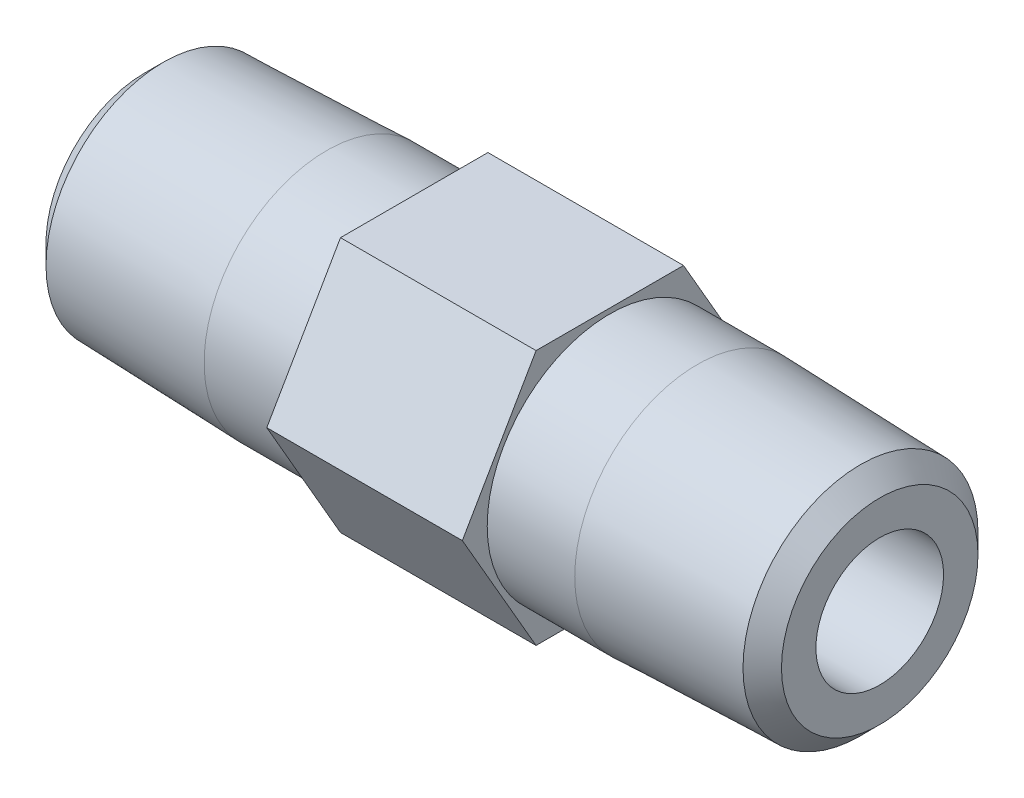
ISO-10303-21;
HEADER;
FILE_DESCRIPTION(('STEP AP214'),'2;1');
FILE_NAME('part.step','',(''),(''),'','','');
FILE_SCHEMA(('AUTOMOTIVE_DESIGN { 1 0 10303 214 1 1 1 1 }'));
ENDSEC;
DATA;
#1=APPLICATION_CONTEXT('core data for automotive mechanical design processes');
#2=APPLICATION_PROTOCOL_DEFINITION('international standard','automotive_design',2000,#1);
#3=PRODUCT_CONTEXT('',#1,'mechanical');
#4=PRODUCT('Part','Part','',(#3));
#5=PRODUCT_RELATED_PRODUCT_CATEGORY('part','',(#4));
#6=PRODUCT_DEFINITION_FORMATION('','',#4);
#7=PRODUCT_DEFINITION_CONTEXT('part definition',#1,'design');
#8=PRODUCT_DEFINITION('design','',#6,#7);
#9=PRODUCT_DEFINITION_SHAPE('','',#8);
#10=(LENGTH_UNIT() NAMED_UNIT(*) SI_UNIT(.MILLI.,.METRE.));
#11=(NAMED_UNIT(*) PLANE_ANGLE_UNIT() SI_UNIT($,.RADIAN.));
#12=(NAMED_UNIT(*) SI_UNIT($,.STERADIAN.) SOLID_ANGLE_UNIT());
#13=UNCERTAINTY_MEASURE_WITH_UNIT(LENGTH_MEASURE(1.E-05),#10,'distance_accuracy_value','');
#14=(GEOMETRIC_REPRESENTATION_CONTEXT(3) GLOBAL_UNCERTAINTY_ASSIGNED_CONTEXT((#13)) GLOBAL_UNIT_ASSIGNED_CONTEXT((#10,
#11,#12)) REPRESENTATION_CONTEXT('',''));
#15=CARTESIAN_POINT('',(0.,0.,0.));
#16=DIRECTION('',(0.,0.,1.));
#17=DIRECTION('',(1.,0.,0.));
#18=AXIS2_PLACEMENT_3D('',#15,#16,#17);
#19=CARTESIAN_POINT('',(15.10284,0.,0.));
#20=DIRECTION('',(1.,0.,0.));
#21=DIRECTION('',(0.,1.,0.));
#22=AXIS2_PLACEMENT_3D('',#19,#20,#21);
#23=PLANE('',#22);
#24=CARTESIAN_POINT('',(15.10284,0.,0.));
#25=DIRECTION('',(-1.,0.,0.));
#26=DIRECTION('',(0.,0.,1.));
#27=AXIS2_PLACEMENT_3D('',#24,#25,#26);
#28=CIRCLE('',#27,3.571875);
#29=CARTESIAN_POINT('',(15.10284,0.,3.571875));
#30=VERTEX_POINT('',#29);
#31=EDGE_CURVE('E19',#30,#30,#28,.T.);
#32=ORIENTED_EDGE('',*,*,#31,.T.);
#33=EDGE_LOOP('',(#32));
#34=FACE_BOUND('',#33,.T.);
#35=ADVANCED_FACE('F16',(#34),#23,.F.);
#36=CARTESIAN_POINT('',(7.55142,0.,0.));
#37=DIRECTION('',(-1.,0.,0.));
#38=DIRECTION('',(0.,0.,1.));
#39=AXIS2_PLACEMENT_3D('',#36,#37,#38);
#40=CYLINDRICAL_SURFACE('',#39,3.571875);
#41=CARTESIAN_POINT('',(0.,0.,0.));
#42=DIRECTION('',(-1.,0.,0.));
#43=DIRECTION('',(0.,0.,1.));
#44=AXIS2_PLACEMENT_3D('',#41,#42,#43);
#45=CIRCLE('',#44,3.571875);
#46=CARTESIAN_POINT('',(0.,0.,3.571875));
#47=VERTEX_POINT('',#46);
#48=EDGE_CURVE('E120',#47,#47,#45,.F.);
#49=ORIENTED_EDGE('',*,*,#48,.F.);
#50=EDGE_LOOP('',(#49));
#51=FACE_BOUND('',#50,.T.);
#52=ORIENTED_EDGE('',*,*,#31,.F.);
#53=EDGE_LOOP('',(#52));
#54=FACE_BOUND('',#53,.T.);
#55=ADVANCED_FACE('F128',(#51,#54),#40,.F.);
#56=CARTESIAN_POINT('',(0.,0.,-3.27012197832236));
#57=DIRECTION('',(-1.,0.,0.));
#58=DIRECTION('',(0.,-1.,0.));
#59=AXIS2_PLACEMENT_3D('',#56,#57,#58);
#60=PLANE('',#59);
#61=CARTESIAN_POINT('',(5.6844286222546E-11,0.,0.));
#62=DIRECTION('',(1.,0.,0.));
#63=DIRECTION('',(0.,1.,0.));
#64=AXIS2_PLACEMENT_3D('',#61,#62,#63);
#65=CIRCLE('',#64,5.4978300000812);
#66=CARTESIAN_POINT('',(5.68448966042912E-11,5.4978300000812,0.));
#67=VERTEX_POINT('',#66);
#68=EDGE_CURVE('E103',#67,#67,#65,.F.);
#69=ORIENTED_EDGE('',*,*,#68,.T.);
#70=EDGE_LOOP('',(#69));
#71=FACE_BOUND('',#70,.T.);
#72=ORIENTED_EDGE('',*,*,#48,.T.);
#73=EDGE_LOOP('',(#72));
#74=FACE_BOUND('',#73,.T.);
#75=ADVANCED_FACE('F130',(#71,#74),#60,.T.);
#76=CARTESIAN_POINT('',(-5.68428084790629E-11,0.,0.));
#77=DIRECTION('',(1.,0.,0.));
#78=DIRECTION('',(0.,1.,0.));
#79=AXIS2_PLACEMENT_3D('',#76,#77,#78);
#80=CONICAL_SURFACE('',#79,5.49782999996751,0.785398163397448);
#81=ORIENTED_EDGE('',*,*,#68,.F.);
#82=EDGE_LOOP('',(#81));
#83=FACE_BOUND('',#82,.T.);
#84=CARTESIAN_POINT('',(1.07591259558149,0.,0.));
#85=DIRECTION('',(1.,0.,0.));
#86=DIRECTION('',(0.,0.,-1.));
#87=AXIS2_PLACEMENT_3D('',#84,#85,#86);
#88=CIRCLE('',#87,6.57374259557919);
#89=CARTESIAN_POINT('',(1.07591259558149,0.,-6.57374259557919));
#90=VERTEX_POINT('',#89);
#91=EDGE_CURVE('E100',#90,#90,#88,.T.);
#92=ORIENTED_EDGE('',*,*,#91,.F.);
#93=EDGE_LOOP('',(#92));
#94=FACE_BOUND('',#93,.T.);
#95=ADVANCED_FACE('F137',(#83,#94),#80,.T.);
#96=CARTESIAN_POINT('',(10.2057199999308,0.,0.));
#97=DIRECTION('',(1.,0.,0.));
#98=DIRECTION('',(0.,1.,0.));
#99=AXIS2_PLACEMENT_3D('',#96,#97,#98);
#100=CONICAL_SURFACE('',#99,6.85799999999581,0.0311250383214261);
#101=ORIENTED_EDGE('',*,*,#91,.T.);
#102=EDGE_LOOP('',(#101));
#103=FACE_BOUND('',#102,.T.);
#104=CARTESIAN_POINT('',(10.20572,0.,0.));
#105=DIRECTION('',(1.,0.,0.));
#106=DIRECTION('',(0.,0.,-1.));
#107=AXIS2_PLACEMENT_3D('',#104,#105,#106);
#108=CIRCLE('',#107,6.858);
#109=CARTESIAN_POINT('',(10.20572,0.,-6.858));
#110=VERTEX_POINT('',#109);
#111=EDGE_CURVE('E96',#110,#110,#108,.T.);
#112=ORIENTED_EDGE('',*,*,#111,.F.);
#113=EDGE_LOOP('',(#112));
#114=FACE_BOUND('',#113,.T.);
#115=ADVANCED_FACE('F198',(#103,#114),#100,.T.);
#116=CARTESIAN_POINT('',(12.65428,0.,0.));
#117=DIRECTION('',(1.,0.,0.));
#118=DIRECTION('',(0.,0.,-1.));
#119=AXIS2_PLACEMENT_3D('',#116,#117,#118);
#120=CYLINDRICAL_SURFACE('',#119,6.858);
#121=ORIENTED_EDGE('',*,*,#111,.T.);
#122=EDGE_LOOP('',(#121));
#123=FACE_BOUND('',#122,.T.);
#124=CARTESIAN_POINT('',(15.10284,0.,0.));
#125=DIRECTION('',(1.,0.,0.));
#126=DIRECTION('',(0.,0.,-1.));
#127=AXIS2_PLACEMENT_3D('',#124,#125,#126);
#128=CIRCLE('',#127,6.858);
#129=CARTESIAN_POINT('',(15.10284,0.,-6.858));
#130=VERTEX_POINT('',#129);
#131=EDGE_CURVE('E99',#130,#130,#128,.F.);
#132=ORIENTED_EDGE('',*,*,#131,.T.);
#133=EDGE_LOOP('',(#132));
#134=FACE_BOUND('',#133,.T.);
#135=ADVANCED_FACE('F194',(#123,#134),#120,.T.);
#136=CARTESIAN_POINT('',(26.04516,0.,0.));
#137=DIRECTION('',(1.,0.,0.));
#138=DIRECTION('',(0.,1.,0.));
#139=AXIS2_PLACEMENT_3D('',#136,#137,#138);
#140=PLANE('',#139);
#141=CARTESIAN_POINT('',(26.04516,0.,0.));
#142=DIRECTION('',(1.,0.,0.));
#143=DIRECTION('',(0.,0.,-1.));
#144=AXIS2_PLACEMENT_3D('',#141,#142,#143);
#145=CIRCLE('',#144,3.571875);
#146=CARTESIAN_POINT('',(26.04516,0.,-3.571875));
#147=VERTEX_POINT('',#146);
#148=EDGE_CURVE('E85',#147,#147,#145,.T.);
#149=ORIENTED_EDGE('',*,*,#148,.T.);
#150=EDGE_LOOP('',(#149));
#151=FACE_BOUND('',#150,.T.);
#152=ADVANCED_FACE('F190',(#151),#140,.T.);
#153=CARTESIAN_POINT('',(15.10284,0.,0.));
#154=DIRECTION('',(1.,0.,0.));
#155=DIRECTION('',(0.,1.,0.));
#156=AXIS2_PLACEMENT_3D('',#153,#154,#155);
#157=PLANE('',#156);
#158=ORIENTED_EDGE('',*,*,#131,.F.);
#159=EDGE_LOOP('',(#158));
#160=FACE_BOUND('',#159,.T.);
#161=DIRECTION('',(0.,0.,-1.));
#162=VECTOR('',#161,1.);
#163=CARTESIAN_POINT('',(15.10284,-7.14375,-4.12444598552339));
#164=LINE('',#163,#162);
#165=CARTESIAN_POINT('',(15.10284,-7.14375,4.12444598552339));
#166=VERTEX_POINT('',#165);
#167=CARTESIAN_POINT('',(15.10284,-7.14375,-4.12444598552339));
#168=VERTEX_POINT('',#167);
#169=EDGE_CURVE('E72',#166,#168,#164,.T.);
#170=ORIENTED_EDGE('',*,*,#169,.F.);
#171=DIRECTION('',(0.,-0.866025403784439,-0.5));
#172=VECTOR('',#171,1.);
#173=CARTESIAN_POINT('',(15.10284,-7.14375,4.12444598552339));
#174=LINE('',#173,#172);
#175=CARTESIAN_POINT('',(15.10284,0.,8.24889197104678));
#176=VERTEX_POINT('',#175);
#177=EDGE_CURVE('E428',#176,#166,#174,.T.);
#178=ORIENTED_EDGE('',*,*,#177,.F.);
#179=DIRECTION('',(0.,-0.866025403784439,0.5));
#180=VECTOR('',#179,1.);
#181=CARTESIAN_POINT('',(15.10284,0.,8.24889197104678));
#182=LINE('',#181,#180);
#183=CARTESIAN_POINT('',(15.10284,7.14375,4.12444598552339));
#184=VERTEX_POINT('',#183);
#185=EDGE_CURVE('E433',#184,#176,#182,.T.);
#186=ORIENTED_EDGE('',*,*,#185,.F.);
#187=DIRECTION('',(0.,0.,1.));
#188=VECTOR('',#187,1.);
#189=CARTESIAN_POINT('',(15.10284,7.14375,4.12444598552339));
#190=LINE('',#189,#188);
#191=CARTESIAN_POINT('',(15.10284,7.14375,-4.1244459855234));
#192=VERTEX_POINT('',#191);
#193=EDGE_CURVE('E436',#192,#184,#190,.T.);
#194=ORIENTED_EDGE('',*,*,#193,.F.);
#195=DIRECTION('',(0.,0.866025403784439,0.5));
#196=VECTOR('',#195,1.);
#197=CARTESIAN_POINT('',(15.10284,7.14375,-4.1244459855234));
#198=LINE('',#197,#196);
#199=CARTESIAN_POINT('',(15.10284,0.,-8.24889197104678));
#200=VERTEX_POINT('',#199);
#201=EDGE_CURVE('E67',#200,#192,#198,.T.);
#202=ORIENTED_EDGE('',*,*,#201,.F.);
#203=DIRECTION('',(0.,0.866025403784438,-0.500000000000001));
#204=VECTOR('',#203,1.);
#205=CARTESIAN_POINT('',(15.10284,0.,-8.24889197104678));
#206=LINE('',#205,#204);
#207=EDGE_CURVE('E69',#168,#200,#206,.T.);
#208=ORIENTED_EDGE('',*,*,#207,.F.);
#209=EDGE_LOOP('',(#170,#178,#186,#194,#202,#208));
#210=FACE_BOUND('',#209,.T.);
#211=ADVANCED_FACE('F71',(#160,#210),#157,.F.);
#212=CARTESIAN_POINT('',(33.59658,0.,0.));
#213=DIRECTION('',(1.,0.,0.));
#214=DIRECTION('',(0.,0.,-1.));
#215=AXIS2_PLACEMENT_3D('',#212,#213,#214);
#216=CYLINDRICAL_SURFACE('',#215,3.571875);
#217=CARTESIAN_POINT('',(41.148,0.,0.));
#218=DIRECTION('',(1.,0.,0.));
#219=DIRECTION('',(0.,0.,-1.));
#220=AXIS2_PLACEMENT_3D('',#217,#218,#219);
#221=CIRCLE('',#220,3.571875);
#222=CARTESIAN_POINT('',(41.148,0.,-3.571875));
#223=VERTEX_POINT('',#222);
#224=EDGE_CURVE('E111',#223,#223,#221,.F.);
#225=ORIENTED_EDGE('',*,*,#224,.F.);
#226=EDGE_LOOP('',(#225));
#227=FACE_BOUND('',#226,.T.);
#228=ORIENTED_EDGE('',*,*,#148,.F.);
#229=EDGE_LOOP('',(#228));
#230=FACE_BOUND('',#229,.T.);
#231=ADVANCED_FACE('F184',(#227,#230),#216,.F.);
#232=CARTESIAN_POINT('',(15.10284,-7.14375,-4.12444598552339));
#233=DIRECTION('',(0.,-1.,0.));
#234=DIRECTION('',(0.,0.,-1.));
#235=AXIS2_PLACEMENT_3D('',#232,#233,#234);
#236=PLANE('',#235);
#237=DIRECTION('',(0.,0.,1.));
#238=VECTOR('',#237,1.);
#239=CARTESIAN_POINT('',(26.04516,-7.14375,0.));
#240=LINE('',#239,#238);
#241=CARTESIAN_POINT('',(26.04516,-7.14375,4.12444598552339));
#242=VERTEX_POINT('',#241);
#243=CARTESIAN_POINT('',(26.04516,-7.14375,-4.12444598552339));
#244=VERTEX_POINT('',#243);
#245=EDGE_CURVE('E114',#242,#244,#240,.F.);
#246=ORIENTED_EDGE('',*,*,#245,.F.);
#247=DIRECTION('',(1.,0.,0.));
#248=VECTOR('',#247,1.);
#249=CARTESIAN_POINT('',(15.10284,-7.14375,4.12444598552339));
#250=LINE('',#249,#248);
#251=EDGE_CURVE('E83',#166,#242,#250,.T.);
#252=ORIENTED_EDGE('',*,*,#251,.F.);
#253=ORIENTED_EDGE('',*,*,#169,.T.);
#254=DIRECTION('',(1.,0.,0.));
#255=VECTOR('',#254,1.);
#256=CARTESIAN_POINT('',(15.10284,-7.14375,-4.12444598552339));
#257=LINE('',#256,#255);
#258=EDGE_CURVE('E77',#244,#168,#257,.F.);
#259=ORIENTED_EDGE('',*,*,#258,.F.);
#260=EDGE_LOOP('',(#246,#252,#253,#259));
#261=FACE_BOUND('',#260,.T.);
#262=ADVANCED_FACE('F80',(#261),#236,.T.);
#263=CARTESIAN_POINT('',(15.10284,0.,-8.24889197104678));
#264=DIRECTION('',(0.,-0.500000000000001,-0.866025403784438));
#265=DIRECTION('',(0.,0.866025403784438,-0.500000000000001));
#266=AXIS2_PLACEMENT_3D('',#263,#264,#265);
#267=PLANE('',#266);
#268=DIRECTION('',(0.,0.866025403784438,-0.500000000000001));
#269=VECTOR('',#268,1.);
#270=CARTESIAN_POINT('',(26.04516,-7.14375,-4.12444598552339));
#271=LINE('',#270,#269);
#272=CARTESIAN_POINT('',(26.04516,0.,-8.24889197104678));
#273=VERTEX_POINT('',#272);
#274=EDGE_CURVE('E89',#244,#273,#271,.T.);
#275=ORIENTED_EDGE('',*,*,#274,.F.);
#276=ORIENTED_EDGE('',*,*,#258,.T.);
#277=ORIENTED_EDGE('',*,*,#207,.T.);
#278=DIRECTION('',(1.,0.,0.));
#279=VECTOR('',#278,1.);
#280=CARTESIAN_POINT('',(15.10284,0.,-8.24889197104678));
#281=LINE('',#280,#279);
#282=EDGE_CURVE('E92',#273,#200,#281,.F.);
#283=ORIENTED_EDGE('',*,*,#282,.F.);
#284=EDGE_LOOP('',(#275,#276,#277,#283));
#285=FACE_BOUND('',#284,.T.);
#286=ADVANCED_FACE('F87',(#285),#267,.T.);
#287=CARTESIAN_POINT('',(15.10284,7.14375,-4.1244459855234));
#288=DIRECTION('',(0.,0.5,-0.866025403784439));
#289=DIRECTION('',(0.,0.866025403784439,0.5));
#290=AXIS2_PLACEMENT_3D('',#287,#288,#289);
#291=PLANE('',#290);
#292=DIRECTION('',(0.,0.866025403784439,0.5));
#293=VECTOR('',#292,1.);
#294=CARTESIAN_POINT('',(26.04516,0.,-8.24889197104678));
#295=LINE('',#294,#293);
#296=CARTESIAN_POINT('',(26.04516,7.14375,-4.1244459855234));
#297=VERTEX_POINT('',#296);
#298=EDGE_CURVE('E409',#273,#297,#295,.T.);
#299=ORIENTED_EDGE('',*,*,#298,.F.);
#300=ORIENTED_EDGE('',*,*,#282,.T.);
#301=ORIENTED_EDGE('',*,*,#201,.T.);
#302=DIRECTION('',(1.,0.,0.));
#303=VECTOR('',#302,1.);
#304=CARTESIAN_POINT('',(15.10284,7.14375,-4.1244459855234));
#305=LINE('',#304,#303);
#306=EDGE_CURVE('E411',#297,#192,#305,.F.);
#307=ORIENTED_EDGE('',*,*,#306,.F.);
#308=EDGE_LOOP('',(#299,#300,#301,#307));
#309=FACE_BOUND('',#308,.T.);
#310=ADVANCED_FACE('F175',(#309),#291,.T.);
#311=CARTESIAN_POINT('',(15.10284,7.14375,4.12444598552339));
#312=DIRECTION('',(0.,1.,0.));
#313=DIRECTION('',(0.,0.,1.));
#314=AXIS2_PLACEMENT_3D('',#311,#312,#313);
#315=PLANE('',#314);
#316=DIRECTION('',(0.,0.,1.));
#317=VECTOR('',#316,1.);
#318=CARTESIAN_POINT('',(26.04516,7.14374999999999,0.));
#319=LINE('',#318,#317);
#320=CARTESIAN_POINT('',(26.04516,7.14375,4.12444598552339));
#321=VERTEX_POINT('',#320);
#322=EDGE_CURVE('E415',#297,#321,#319,.T.);
#323=ORIENTED_EDGE('',*,*,#322,.F.);
#324=ORIENTED_EDGE('',*,*,#306,.T.);
#325=ORIENTED_EDGE('',*,*,#193,.T.);
#326=DIRECTION('',(1.,0.,0.));
#327=VECTOR('',#326,1.);
#328=CARTESIAN_POINT('',(15.10284,7.14375,4.12444598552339));
#329=LINE('',#328,#327);
#330=EDGE_CURVE('E430',#321,#184,#329,.F.);
#331=ORIENTED_EDGE('',*,*,#330,.F.);
#332=EDGE_LOOP('',(#323,#324,#325,#331));
#333=FACE_BOUND('',#332,.T.);
#334=ADVANCED_FACE('F172',(#333),#315,.T.);
#335=CARTESIAN_POINT('',(15.10284,0.,8.24889197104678));
#336=DIRECTION('',(0.,0.5,0.866025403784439));
#337=DIRECTION('',(0.,-0.866025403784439,0.5));
#338=AXIS2_PLACEMENT_3D('',#335,#336,#337);
#339=PLANE('',#338);
#340=DIRECTION('',(0.,-0.866025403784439,0.5));
#341=VECTOR('',#340,1.);
#342=CARTESIAN_POINT('',(26.04516,7.14375,4.12444598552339));
#343=LINE('',#342,#341);
#344=CARTESIAN_POINT('',(26.04516,0.,8.24889197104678));
#345=VERTEX_POINT('',#344);
#346=EDGE_CURVE('E438',#321,#345,#343,.T.);
#347=ORIENTED_EDGE('',*,*,#346,.F.);
#348=ORIENTED_EDGE('',*,*,#330,.T.);
#349=ORIENTED_EDGE('',*,*,#185,.T.);
#350=DIRECTION('',(1.,0.,0.));
#351=VECTOR('',#350,1.);
#352=CARTESIAN_POINT('',(15.10284,0.,8.24889197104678));
#353=LINE('',#352,#351);
#354=EDGE_CURVE('E34',#345,#176,#353,.F.);
#355=ORIENTED_EDGE('',*,*,#354,.F.);
#356=EDGE_LOOP('',(#347,#348,#349,#355));
#357=FACE_BOUND('',#356,.T.);
#358=ADVANCED_FACE('F168',(#357),#339,.T.);
#359=CARTESIAN_POINT('',(15.10284,-7.14375,4.12444598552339));
#360=DIRECTION('',(0.,-0.5,0.866025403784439));
#361=DIRECTION('',(0.,-0.866025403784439,-0.5));
#362=AXIS2_PLACEMENT_3D('',#359,#360,#361);
#363=PLANE('',#362);
#364=DIRECTION('',(0.,-0.866025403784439,-0.5));
#365=VECTOR('',#364,1.);
#366=CARTESIAN_POINT('',(26.04516,0.,8.24889197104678));
#367=LINE('',#366,#365);
#368=EDGE_CURVE('E110',#345,#242,#367,.T.);
#369=ORIENTED_EDGE('',*,*,#368,.F.);
#370=ORIENTED_EDGE('',*,*,#354,.T.);
#371=ORIENTED_EDGE('',*,*,#177,.T.);
#372=ORIENTED_EDGE('',*,*,#251,.T.);
#373=EDGE_LOOP('',(#369,#370,#371,#372));
#374=FACE_BOUND('',#373,.T.);
#375=ADVANCED_FACE('F164',(#374),#363,.T.);
#376=CARTESIAN_POINT('',(41.148,0.,-3.27012197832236));
#377=DIRECTION('',(1.,0.,0.));
#378=DIRECTION('',(0.,0.,-1.));
#379=AXIS2_PLACEMENT_3D('',#376,#377,#378);
#380=PLANE('',#379);
#381=CARTESIAN_POINT('',(41.1480000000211,0.,0.));
#382=DIRECTION('',(-1.,0.,0.));
#383=DIRECTION('',(0.,0.,1.));
#384=AXIS2_PLACEMENT_3D('',#381,#382,#383);
#385=CIRCLE('',#384,5.49783000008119);
#386=CARTESIAN_POINT('',(41.1480000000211,0.,5.49783000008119));
#387=VERTEX_POINT('',#386);
#388=EDGE_CURVE('E107',#387,#387,#385,.F.);
#389=ORIENTED_EDGE('',*,*,#388,.T.);
#390=EDGE_LOOP('',(#389));
#391=FACE_BOUND('',#390,.T.);
#392=ORIENTED_EDGE('',*,*,#224,.T.);
#393=EDGE_LOOP('',(#392));
#394=FACE_BOUND('',#393,.T.);
#395=ADVANCED_FACE('F160',(#391,#394),#380,.T.);
#396=CARTESIAN_POINT('',(26.04516,0.,0.));
#397=DIRECTION('',(1.,0.,0.));
#398=DIRECTION('',(0.,1.,0.));
#399=AXIS2_PLACEMENT_3D('',#396,#397,#398);
#400=PLANE('',#399);
#401=CARTESIAN_POINT('',(26.04516,0.,0.));
#402=DIRECTION('',(-1.,0.,0.));
#403=DIRECTION('',(0.,0.,1.));
#404=AXIS2_PLACEMENT_3D('',#401,#402,#403);
#405=CIRCLE('',#404,6.858);
#406=CARTESIAN_POINT('',(26.04516,0.,6.858));
#407=VERTEX_POINT('',#406);
#408=EDGE_CURVE('E104',#407,#407,#405,.F.);
#409=ORIENTED_EDGE('',*,*,#408,.F.);
#410=EDGE_LOOP('',(#409));
#411=FACE_BOUND('',#410,.T.);
#412=ORIENTED_EDGE('',*,*,#346,.T.);
#413=ORIENTED_EDGE('',*,*,#368,.T.);
#414=ORIENTED_EDGE('',*,*,#245,.T.);
#415=ORIENTED_EDGE('',*,*,#274,.T.);
#416=ORIENTED_EDGE('',*,*,#298,.T.);
#417=ORIENTED_EDGE('',*,*,#322,.T.);
#418=EDGE_LOOP('',(#412,#413,#414,#415,#416,#417));
#419=FACE_BOUND('',#418,.T.);
#420=ADVANCED_FACE('F156',(#411,#419),#400,.T.);
#421=CARTESIAN_POINT('',(41.1480000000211,0.,0.));
#422=DIRECTION('',(-1.,0.,0.));
#423=DIRECTION('',(0.,0.,1.));
#424=AXIS2_PLACEMENT_3D('',#421,#422,#423);
#425=CONICAL_SURFACE('',#424,5.49783000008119,0.785398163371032);
#426=ORIENTED_EDGE('',*,*,#388,.F.);
#427=EDGE_LOOP('',(#426));
#428=FACE_BOUND('',#427,.T.);
#429=CARTESIAN_POINT('',(40.0720874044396,0.,0.));
#430=DIRECTION('',(-1.,0.,0.));
#431=DIRECTION('',(0.,0.,-1.));
#432=AXIS2_PLACEMENT_3D('',#429,#430,#431);
#433=CIRCLE('',#432,6.57374259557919);
#434=CARTESIAN_POINT('',(40.0720874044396,0.,-6.57374259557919));
#435=VERTEX_POINT('',#434);
#436=EDGE_CURVE('E25',#435,#435,#433,.T.);
#437=ORIENTED_EDGE('',*,*,#436,.F.);
#438=EDGE_LOOP('',(#437));
#439=FACE_BOUND('',#438,.T.);
#440=ADVANCED_FACE('F148',(#428,#439),#425,.T.);
#441=CARTESIAN_POINT('',(28.49372,0.,0.));
#442=DIRECTION('',(-1.,0.,0.));
#443=DIRECTION('',(0.,0.,1.));
#444=AXIS2_PLACEMENT_3D('',#441,#442,#443);
#445=CYLINDRICAL_SURFACE('',#444,6.858);
#446=CARTESIAN_POINT('',(30.9422799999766,0.,0.));
#447=DIRECTION('',(-1.,0.,0.));
#448=DIRECTION('',(0.,0.,-1.));
#449=AXIS2_PLACEMENT_3D('',#446,#447,#448);
#450=CIRCLE('',#449,6.85799999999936);
#451=CARTESIAN_POINT('',(30.9422799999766,0.,-6.85799999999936));
#452=VERTEX_POINT('',#451);
#453=EDGE_CURVE('E11',#452,#452,#450,.F.);
#454=ORIENTED_EDGE('',*,*,#453,.F.);
#455=EDGE_LOOP('',(#454));
#456=FACE_BOUND('',#455,.T.);
#457=ORIENTED_EDGE('',*,*,#408,.T.);
#458=EDGE_LOOP('',(#457));
#459=FACE_BOUND('',#458,.T.);
#460=ADVANCED_FACE('F142',(#456,#459),#445,.T.);
#461=CARTESIAN_POINT('',(30.9422800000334,0.,0.));
#462=DIRECTION('',(-1.,0.,0.));
#463=DIRECTION('',(0.,0.,1.));
#464=AXIS2_PLACEMENT_3D('',#461,#462,#463);
#465=CONICAL_SURFACE('',#464,6.85799999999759,0.0311250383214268);
#466=ORIENTED_EDGE('',*,*,#436,.T.);
#467=EDGE_LOOP('',(#466));
#468=FACE_BOUND('',#467,.T.);
#469=ORIENTED_EDGE('',*,*,#453,.T.);
#470=EDGE_LOOP('',(#469));
#471=FACE_BOUND('',#470,.T.);
#472=ADVANCED_FACE('F140',(#468,#471),#465,.T.);
#473=CLOSED_SHELL('',(#35,#55,#75,#95,#115,#135,#152,#211,#231,#262,#286,#310,#334,#358,#375,
#395,#420,#440,#460,#472));
#474=MANIFOLD_SOLID_BREP('B1',#473);
#475=ADVANCED_BREP_SHAPE_REPRESENTATION('',(#18,#474),#14);
#476=SHAPE_DEFINITION_REPRESENTATION(#9,#475);
ENDSEC;
END-ISO-10303-21;
